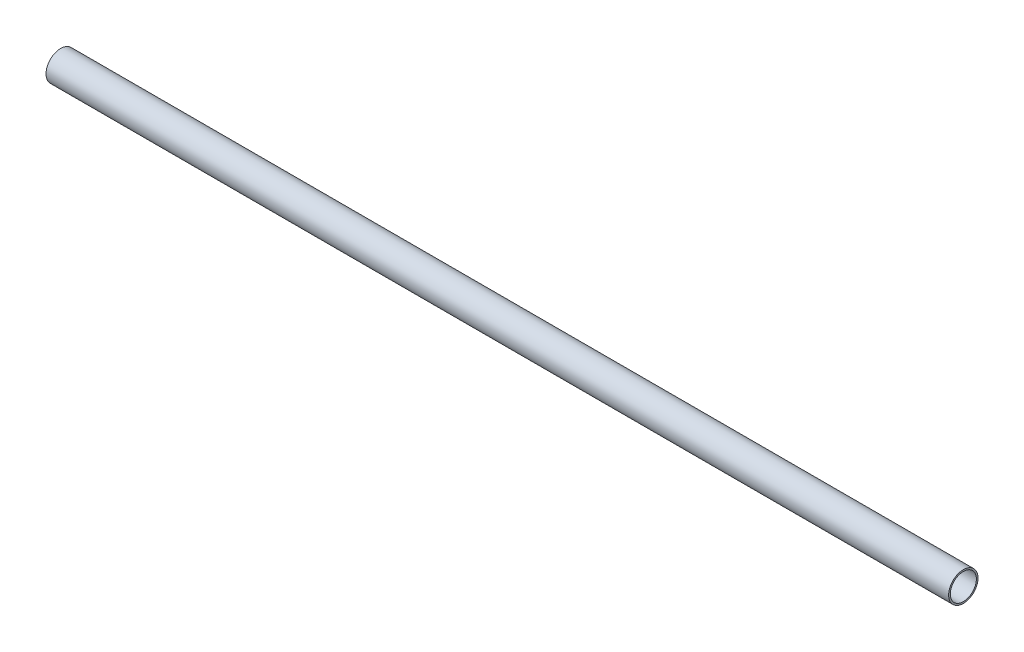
ISO-10303-21;
HEADER;
FILE_DESCRIPTION(('STEP AP214'),'2;1');
FILE_NAME('part.step','',(''),(''),'','','');
FILE_SCHEMA(('AUTOMOTIVE_DESIGN { 1 0 10303 214 1 1 1 1 }'));
ENDSEC;
DATA;
#1=APPLICATION_CONTEXT('core data for automotive mechanical design processes');
#2=APPLICATION_PROTOCOL_DEFINITION('international standard','automotive_design',2000,#1);
#3=PRODUCT_CONTEXT('',#1,'mechanical');
#4=PRODUCT('Part','Part','',(#3));
#5=PRODUCT_RELATED_PRODUCT_CATEGORY('part','',(#4));
#6=PRODUCT_DEFINITION_FORMATION('','',#4);
#7=PRODUCT_DEFINITION_CONTEXT('part definition',#1,'design');
#8=PRODUCT_DEFINITION('design','',#6,#7);
#9=PRODUCT_DEFINITION_SHAPE('','',#8);
#10=(LENGTH_UNIT() NAMED_UNIT(*) SI_UNIT(.MILLI.,.METRE.));
#11=(NAMED_UNIT(*) PLANE_ANGLE_UNIT() SI_UNIT($,.RADIAN.));
#12=(NAMED_UNIT(*) SI_UNIT($,.STERADIAN.) SOLID_ANGLE_UNIT());
#13=UNCERTAINTY_MEASURE_WITH_UNIT(LENGTH_MEASURE(1.E-05),#10,'distance_accuracy_value','');
#14=(GEOMETRIC_REPRESENTATION_CONTEXT(3) GLOBAL_UNCERTAINTY_ASSIGNED_CONTEXT((#13)) GLOBAL_UNIT_ASSIGNED_CONTEXT((#10,
#11,#12)) REPRESENTATION_CONTEXT('',''));
#15=CARTESIAN_POINT('',(0.,0.,0.));
#16=DIRECTION('',(0.,0.,1.));
#17=DIRECTION('',(1.,0.,0.));
#18=AXIS2_PLACEMENT_3D('',#15,#16,#17);
#19=CARTESIAN_POINT('',(275.,0.,0.));
#20=DIRECTION('',(-1.,0.,0.));
#21=DIRECTION('',(0.,0.,1.));
#22=AXIS2_PLACEMENT_3D('',#19,#20,#21);
#23=CYLINDRICAL_SURFACE('',#22,7.95);
#24=CARTESIAN_POINT('',(-275.,0.,0.));
#25=DIRECTION('',(-1.,0.,0.));
#26=DIRECTION('',(0.,0.,1.));
#27=AXIS2_PLACEMENT_3D('',#24,#25,#26);
#28=CIRCLE('',#27,7.95);
#29=CARTESIAN_POINT('',(-275.,0.,7.95));
#30=VERTEX_POINT('',#29);
#31=EDGE_CURVE('E27',#30,#30,#28,.T.);
#32=ORIENTED_EDGE('',*,*,#31,.T.);
#33=EDGE_LOOP('',(#32));
#34=FACE_BOUND('',#33,.T.);
#35=CARTESIAN_POINT('',(275.,0.,0.));
#36=DIRECTION('',(-1.,0.,0.));
#37=DIRECTION('',(0.,0.,1.));
#38=AXIS2_PLACEMENT_3D('',#35,#36,#37);
#39=CIRCLE('',#38,7.95);
#40=CARTESIAN_POINT('',(275.,0.,7.95));
#41=VERTEX_POINT('',#40);
#42=EDGE_CURVE('E18',#41,#41,#39,.T.);
#43=ORIENTED_EDGE('',*,*,#42,.F.);
#44=EDGE_LOOP('',(#43));
#45=FACE_BOUND('',#44,.T.);
#46=ADVANCED_FACE('F15',(#34,#45),#23,.F.);
#47=CARTESIAN_POINT('',(275.,0.,0.));
#48=DIRECTION('',(1.,0.,0.));
#49=DIRECTION('',(0.,0.,-1.));
#50=AXIS2_PLACEMENT_3D('',#47,#48,#49);
#51=PLANE('',#50);
#52=ORIENTED_EDGE('',*,*,#42,.T.);
#53=EDGE_LOOP('',(#52));
#54=FACE_BOUND('',#53,.T.);
#55=CARTESIAN_POINT('',(275.,0.,0.));
#56=DIRECTION('',(-1.,0.,0.));
#57=DIRECTION('',(0.,0.,1.));
#58=AXIS2_PLACEMENT_3D('',#55,#56,#57);
#59=CIRCLE('',#58,8.95);
#60=CARTESIAN_POINT('',(275.,0.,8.95));
#61=VERTEX_POINT('',#60);
#62=EDGE_CURVE('E22',#61,#61,#59,.T.);
#63=ORIENTED_EDGE('',*,*,#62,.F.);
#64=EDGE_LOOP('',(#63));
#65=FACE_BOUND('',#64,.T.);
#66=ADVANCED_FACE('F35',(#54,#65),#51,.T.);
#67=CARTESIAN_POINT('',(-275.,0.,0.));
#68=DIRECTION('',(1.,0.,0.));
#69=DIRECTION('',(0.,0.,-1.));
#70=AXIS2_PLACEMENT_3D('',#67,#68,#69);
#71=PLANE('',#70);
#72=ORIENTED_EDGE('',*,*,#31,.F.);
#73=EDGE_LOOP('',(#72));
#74=FACE_BOUND('',#73,.T.);
#75=CARTESIAN_POINT('',(-275.,0.,0.));
#76=DIRECTION('',(-1.,0.,0.));
#77=DIRECTION('',(0.,0.,1.));
#78=AXIS2_PLACEMENT_3D('',#75,#76,#77);
#79=CIRCLE('',#78,8.95);
#80=CARTESIAN_POINT('',(-275.,0.,8.95));
#81=VERTEX_POINT('',#80);
#82=EDGE_CURVE('E10',#81,#81,#79,.F.);
#83=ORIENTED_EDGE('',*,*,#82,.F.);
#84=EDGE_LOOP('',(#83));
#85=FACE_BOUND('',#84,.T.);
#86=ADVANCED_FACE('F43',(#74,#85),#71,.F.);
#87=CARTESIAN_POINT('',(275.,0.,0.));
#88=DIRECTION('',(-1.,0.,0.));
#89=DIRECTION('',(0.,0.,1.));
#90=AXIS2_PLACEMENT_3D('',#87,#88,#89);
#91=CYLINDRICAL_SURFACE('',#90,8.95);
#92=ORIENTED_EDGE('',*,*,#82,.T.);
#93=EDGE_LOOP('',(#92));
#94=FACE_BOUND('',#93,.T.);
#95=ORIENTED_EDGE('',*,*,#62,.T.);
#96=EDGE_LOOP('',(#95));
#97=FACE_BOUND('',#96,.T.);
#98=ADVANCED_FACE('F44',(#94,#97),#91,.T.);
#99=CLOSED_SHELL('',(#46,#66,#86,#98));
#100=MANIFOLD_SOLID_BREP('B1',#99);
#101=ADVANCED_BREP_SHAPE_REPRESENTATION('',(#18,#100),#14);
#102=SHAPE_DEFINITION_REPRESENTATION(#9,#101);
ENDSEC;
END-ISO-10303-21;
